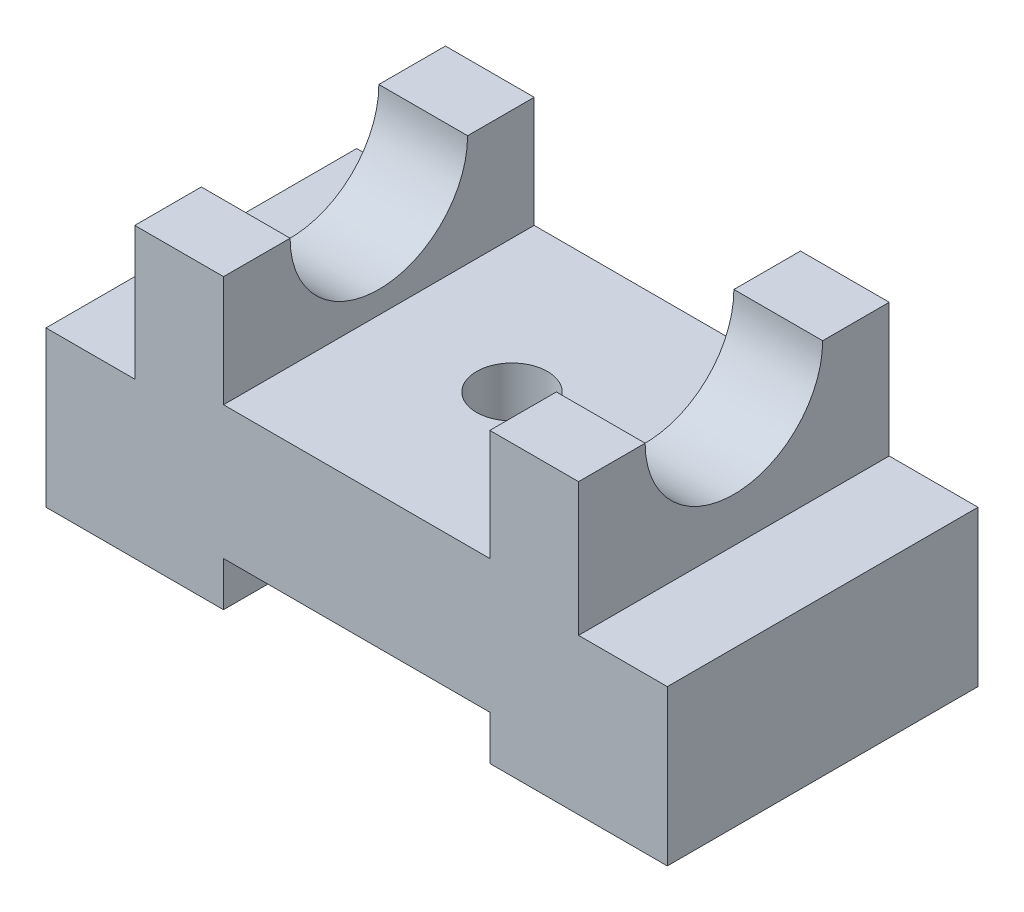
from build123d import *

# Parameters (mm, degrees)
BOSS_EXTRUDE1_DEPTH = 35
SKETCH2_R           = 20
CUT_EXTRUDE1_DEPTH  = 132.244047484
SKETCH3_R           = 8
CUT_EXTRUDE2_DEPTH  = 88.891979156


with BuildPart() as part:
    # Sketch1 → Boss-Extrude1 (new, symmetric)
    with BuildSketch(Plane.XY):
        Polygon((-30, 0), (30, 0), (30, 25), (50, 25), (50, -5), (70, -5), (70, -40), (30, -40), (30, -30), (-30, -30), (-30, -40), (-70, -40), (-70, -5), (-50, -5), (-50, 25), (-30, 25), align=None)
    extrude(amount=BOSS_EXTRUDE1_DEPTH, both=True)

    # Sketch2 → Cut-Extrude1 (cut, through all)
    with BuildSketch(Plane(origin=(50, 0, 0), x_dir=(0, 0, -1), z_dir=(1, 0, 0))):
        with Locations((0, 25)):
            Circle(SKETCH2_R)
    extrude(amount=-CUT_EXTRUDE1_DEPTH, mode=Mode.SUBTRACT)

    # Sketch3 → Cut-Extrude2 (cut, through all)
    with BuildSketch(Plane(origin=(0, 0, 0), x_dir=(1, 0, 0), z_dir=(0, 1, 0))):
        with Locations(Location((0, 0, 0), (0, 0, 270))):
            Circle(SKETCH3_R)
    extrude(amount=-CUT_EXTRUDE2_DEPTH, mode=Mode.SUBTRACT)


solid = part.part
